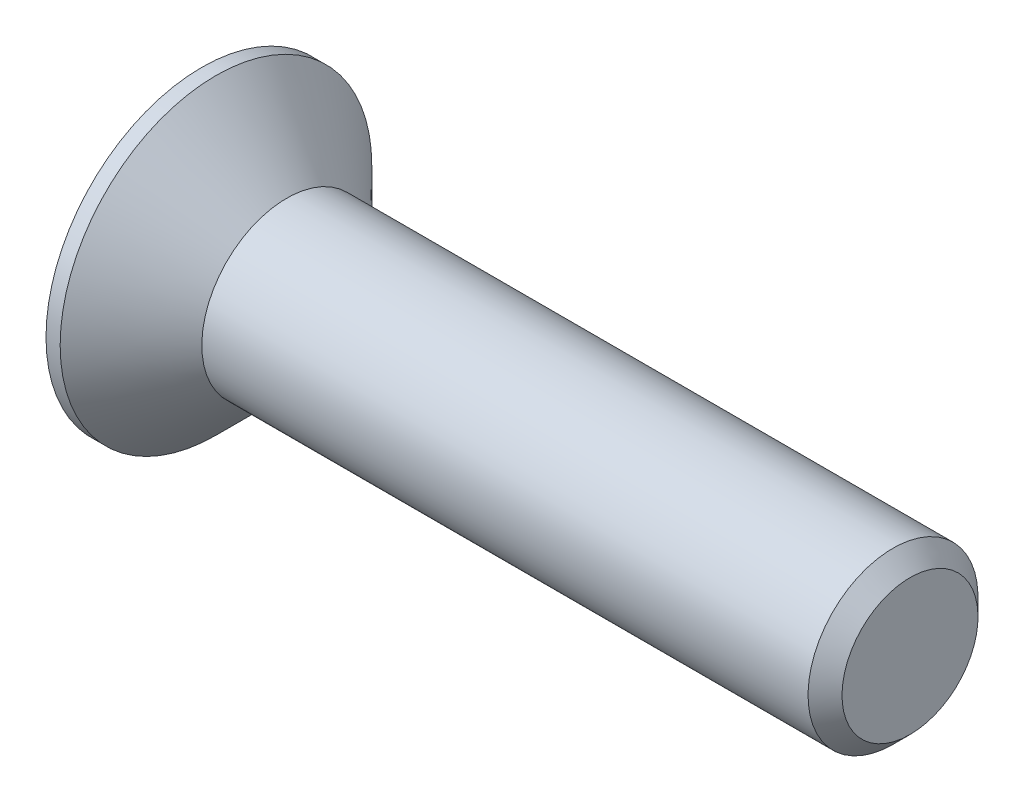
from build123d import *

# Parameters (mm, degrees)
CHAMFER1_SIZE      = 0.6
CUT_EXTRUDE1_DEPTH = 2.5


with BuildPart() as part:
    # Sketch1 → Revolve1 (revolve)
    with BuildSketch(Plane.XY, mode=Mode.PRIVATE) as revolve1_sk:
        Polygon((-3, 5.5), (-3, 0), (22, 0), (22, 3), (0, 3), (-2.5, 5.5), align=None)
    revolve(revolve1_sk.sketch.rotate(Axis((-3, 0, 0), (1, 0, 0)), 180), axis=Axis((-3, 0, 0), (1, 0, 0)))

    # Chamfer1
    chamfer1_edges = [part.edges().sort_by_distance(p)[0] for p in [
        (22, 3, 0),
    ]]
    chamfer(chamfer1_edges, length=CHAMFER1_SIZE)

    # Sketch2 → Cut-Extrude1 (cut)
    with BuildSketch(Plane.ZY.offset(3)):
        Polygon((-0.825, 3.3), (0.825, 3.3), (0.825, 0.825), (3.3, 0.825), (3.3, -0.825), (0.825, -0.825), (0.825, -3.3), (-0.825, -3.3), (-0.825, -0.825), (-3.3, -0.825), (-3.3, 0.825), (-0.825, 0.825), align=None)
    extrude(amount=-CUT_EXTRUDE1_DEPTH, mode=Mode.SUBTRACT)


solid = part.part
